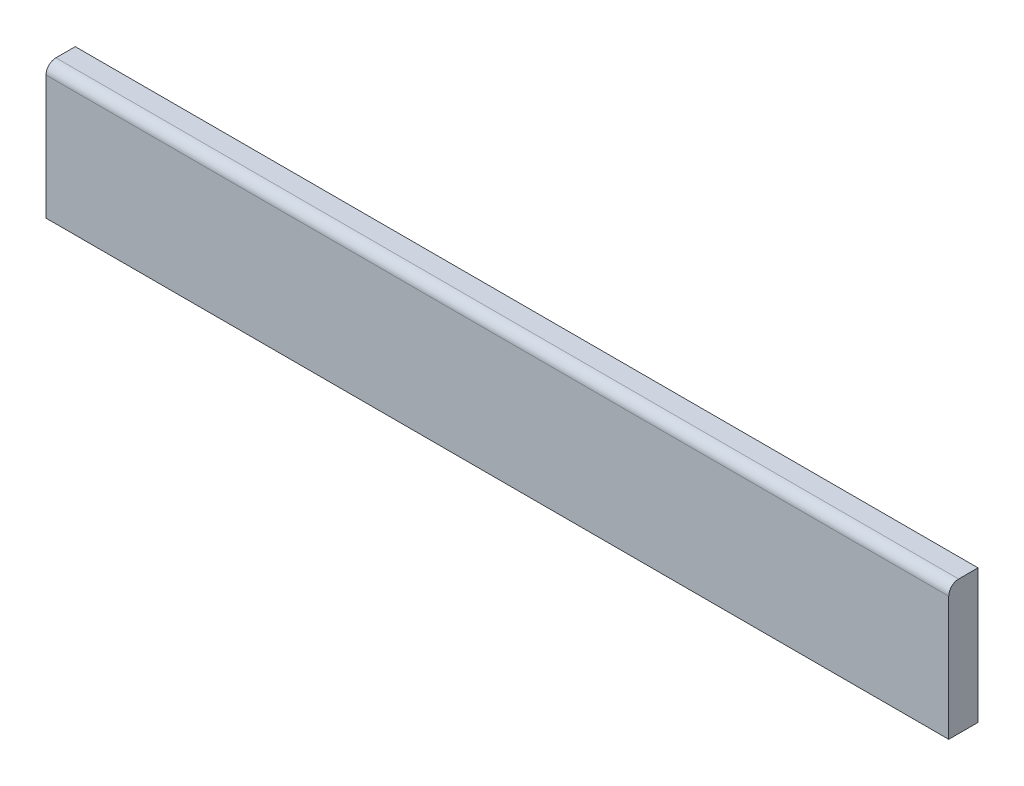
ISO-10303-21;
HEADER;
FILE_DESCRIPTION(('STEP AP214'),'2;1');
FILE_NAME('part.step','',(''),(''),'','','');
FILE_SCHEMA(('AUTOMOTIVE_DESIGN { 1 0 10303 214 1 1 1 1 }'));
ENDSEC;
DATA;
#1=APPLICATION_CONTEXT('core data for automotive mechanical design processes');
#2=APPLICATION_PROTOCOL_DEFINITION('international standard','automotive_design',2000,#1);
#3=PRODUCT_CONTEXT('',#1,'mechanical');
#4=PRODUCT('Part','Part','',(#3));
#5=PRODUCT_RELATED_PRODUCT_CATEGORY('part','',(#4));
#6=PRODUCT_DEFINITION_FORMATION('','',#4);
#7=PRODUCT_DEFINITION_CONTEXT('part definition',#1,'design');
#8=PRODUCT_DEFINITION('design','',#6,#7);
#9=PRODUCT_DEFINITION_SHAPE('','',#8);
#10=(LENGTH_UNIT() NAMED_UNIT(*) SI_UNIT(.MILLI.,.METRE.));
#11=(NAMED_UNIT(*) PLANE_ANGLE_UNIT() SI_UNIT($,.RADIAN.));
#12=(NAMED_UNIT(*) SI_UNIT($,.STERADIAN.) SOLID_ANGLE_UNIT());
#13=UNCERTAINTY_MEASURE_WITH_UNIT(LENGTH_MEASURE(1.E-05),#10,'distance_accuracy_value','');
#14=(GEOMETRIC_REPRESENTATION_CONTEXT(3) GLOBAL_UNCERTAINTY_ASSIGNED_CONTEXT((#13)) GLOBAL_UNIT_ASSIGNED_CONTEXT((#10,
#11,#12)) REPRESENTATION_CONTEXT('',''));
#15=CARTESIAN_POINT('',(0.,0.,0.));
#16=DIRECTION('',(0.,0.,1.));
#17=DIRECTION('',(1.,0.,0.));
#18=AXIS2_PLACEMENT_3D('',#15,#16,#17);
#19=CARTESIAN_POINT('',(0.,0.,0.));
#20=DIRECTION('',(0.,0.,1.));
#21=DIRECTION('',(1.,0.,0.));
#22=AXIS2_PLACEMENT_3D('',#19,#20,#21);
#23=PLANE('',#22);
#24=CARTESIAN_POINT('',(27.,-76.9999999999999,0.));
#25=DIRECTION('',(0.,0.,1.));
#26=DIRECTION('',(1.,0.,0.));
#27=AXIS2_PLACEMENT_3D('',#24,#25,#26);
#28=CIRCLE('',#27,5.);
#29=CARTESIAN_POINT('',(32.,-76.9999999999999,0.));
#30=VERTEX_POINT('',#29);
#31=EDGE_CURVE('E158',#30,#30,#28,.T.);
#32=ORIENTED_EDGE('',*,*,#31,.T.);
#33=EDGE_LOOP('',(#32));
#34=FACE_BOUND('',#33,.T.);
#35=CARTESIAN_POINT('',(27.,-40.9999999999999,0.));
#36=DIRECTION('',(0.,0.,1.));
#37=DIRECTION('',(1.,0.,0.));
#38=AXIS2_PLACEMENT_3D('',#35,#36,#37);
#39=CIRCLE('',#38,5.);
#40=CARTESIAN_POINT('',(32.,-40.9999999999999,0.));
#41=VERTEX_POINT('',#40);
#42=EDGE_CURVE('E149',#41,#41,#39,.T.);
#43=ORIENTED_EDGE('',*,*,#42,.T.);
#44=EDGE_LOOP('',(#43));
#45=FACE_BOUND('',#44,.T.);
#46=CARTESIAN_POINT('',(-27.,-40.9999999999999,0.));
#47=DIRECTION('',(0.,0.,1.));
#48=DIRECTION('',(1.,0.,0.));
#49=AXIS2_PLACEMENT_3D('',#46,#47,#48);
#50=CIRCLE('',#49,5.);
#51=CARTESIAN_POINT('',(-22.,-40.9999999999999,0.));
#52=VERTEX_POINT('',#51);
#53=EDGE_CURVE('E144',#52,#52,#50,.T.);
#54=ORIENTED_EDGE('',*,*,#53,.T.);
#55=EDGE_LOOP('',(#54));
#56=FACE_BOUND('',#55,.T.);
#57=CARTESIAN_POINT('',(-27.,-76.9999999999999,0.));
#58=DIRECTION('',(0.,0.,1.));
#59=DIRECTION('',(1.,0.,0.));
#60=AXIS2_PLACEMENT_3D('',#57,#58,#59);
#61=CIRCLE('',#60,5.);
#62=CARTESIAN_POINT('',(-22.,-76.9999999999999,0.));
#63=VERTEX_POINT('',#62);
#64=EDGE_CURVE('E148',#63,#63,#61,.T.);
#65=ORIENTED_EDGE('',*,*,#64,.T.);
#66=EDGE_LOOP('',(#65));
#67=FACE_BOUND('',#66,.T.);
#68=DIRECTION('',(-1.,0.,0.));
#69=VECTOR('',#68,1.);
#70=CARTESIAN_POINT('',(-949.,113.,0.));
#71=LINE('',#70,#69);
#72=CARTESIAN_POINT('',(910.,113.,6.88846842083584E-13));
#73=VERTEX_POINT('',#72);
#74=CARTESIAN_POINT('',(-910.,113.,-1.10138778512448E-12));
#75=VERTEX_POINT('',#74);
#76=EDGE_CURVE('E102',#73,#75,#71,.T.);
#77=ORIENTED_EDGE('',*,*,#76,.F.);
#78=DIRECTION('',(0.,1.,0.));
#79=VECTOR('',#78,1.);
#80=CARTESIAN_POINT('',(910.,-157.,7.33810874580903E-13));
#81=LINE('',#80,#79);
#82=CARTESIAN_POINT('',(910.,-157.,7.33810874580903E-13));
#83=VERTEX_POINT('',#82);
#84=EDGE_CURVE('E87',#83,#73,#81,.T.);
#85=ORIENTED_EDGE('',*,*,#84,.F.);
#86=DIRECTION('',(1.,0.,0.));
#87=VECTOR('',#86,1.);
#88=CARTESIAN_POINT('',(-949.,-157.,0.));
#89=LINE('',#88,#87);
#90=CARTESIAN_POINT('',(-910.,-157.,-1.05642375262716E-12));
#91=VERTEX_POINT('',#90);
#92=EDGE_CURVE('E100',#91,#83,#89,.T.);
#93=ORIENTED_EDGE('',*,*,#92,.F.);
#94=DIRECTION('',(0.,1.,0.));
#95=VECTOR('',#94,1.);
#96=CARTESIAN_POINT('',(-910.,-157.,-1.05642375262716E-12));
#97=LINE('',#96,#95);
#98=EDGE_CURVE('E141',#91,#75,#97,.T.);
#99=ORIENTED_EDGE('',*,*,#98,.T.);
#100=EDGE_LOOP('',(#77,#85,#93,#99));
#101=FACE_BOUND('',#100,.T.);
#102=CARTESIAN_POINT('',(-490.,0.,0.));
#103=DIRECTION('',(0.,0.,1.));
#104=DIRECTION('',(1.,0.,0.));
#105=AXIS2_PLACEMENT_3D('',#102,#103,#104);
#106=CIRCLE('',#105,5.00000000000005);
#107=CARTESIAN_POINT('',(-485.,0.,0.));
#108=VERTEX_POINT('',#107);
#109=EDGE_CURVE('E108',#108,#108,#106,.T.);
#110=ORIENTED_EDGE('',*,*,#109,.T.);
#111=EDGE_LOOP('',(#110));
#112=FACE_BOUND('',#111,.T.);
#113=CARTESIAN_POINT('',(-855.,0.,0.));
#114=DIRECTION('',(0.,0.,1.));
#115=DIRECTION('',(1.,0.,0.));
#116=AXIS2_PLACEMENT_3D('',#113,#114,#115);
#117=CIRCLE('',#116,5.00000000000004);
#118=CARTESIAN_POINT('',(-850.,0.,0.));
#119=VERTEX_POINT('',#118);
#120=EDGE_CURVE('E115',#119,#119,#117,.T.);
#121=ORIENTED_EDGE('',*,*,#120,.T.);
#122=EDGE_LOOP('',(#121));
#123=FACE_BOUND('',#122,.T.);
#124=CARTESIAN_POINT('',(-125.,0.,0.));
#125=DIRECTION('',(0.,0.,1.));
#126=DIRECTION('',(1.,0.,0.));
#127=AXIS2_PLACEMENT_3D('',#124,#125,#126);
#128=CIRCLE('',#127,4.99999999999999);
#129=CARTESIAN_POINT('',(-120.,0.,0.));
#130=VERTEX_POINT('',#129);
#131=EDGE_CURVE('E258',#130,#130,#128,.T.);
#132=ORIENTED_EDGE('',*,*,#131,.T.);
#133=EDGE_LOOP('',(#132));
#134=FACE_BOUND('',#133,.T.);
#135=CARTESIAN_POINT('',(-872.6,-136.999999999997,0.));
#136=DIRECTION('',(0.,0.,1.));
#137=DIRECTION('',(1.,0.,0.));
#138=AXIS2_PLACEMENT_3D('',#135,#136,#137);
#139=CIRCLE('',#138,5.00000000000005);
#140=CARTESIAN_POINT('',(-867.6,-136.999999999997,0.));
#141=VERTEX_POINT('',#140);
#142=EDGE_CURVE('E251',#141,#141,#139,.T.);
#143=ORIENTED_EDGE('',*,*,#142,.T.);
#144=EDGE_LOOP('',(#143));
#145=FACE_BOUND('',#144,.T.);
#146=CARTESIAN_POINT('',(-872.6,-56.9999999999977,0.));
#147=DIRECTION('',(0.,0.,1.));
#148=DIRECTION('',(1.,0.,0.));
#149=AXIS2_PLACEMENT_3D('',#146,#147,#148);
#150=CIRCLE('',#149,5.00000000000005);
#151=CARTESIAN_POINT('',(-867.6,-56.9999999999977,0.));
#152=VERTEX_POINT('',#151);
#153=EDGE_CURVE('E244',#152,#152,#150,.T.);
#154=ORIENTED_EDGE('',*,*,#153,.T.);
#155=EDGE_LOOP('',(#154));
#156=FACE_BOUND('',#155,.T.);
#157=CARTESIAN_POINT('',(-793.,-142.000000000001,0.));
#158=DIRECTION('',(0.,0.,1.));
#159=DIRECTION('',(1.,0.,0.));
#160=AXIS2_PLACEMENT_3D('',#157,#158,#159);
#161=CIRCLE('',#160,5.00000000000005);
#162=CARTESIAN_POINT('',(-788.,-142.000000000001,0.));
#163=VERTEX_POINT('',#162);
#164=EDGE_CURVE('E237',#163,#163,#161,.T.);
#165=ORIENTED_EDGE('',*,*,#164,.T.);
#166=EDGE_LOOP('',(#165));
#167=FACE_BOUND('',#166,.T.);
#168=CARTESIAN_POINT('',(872.6,-136.999999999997,0.));
#169=DIRECTION('',(0.,0.,1.));
#170=DIRECTION('',(1.,0.,0.));
#171=AXIS2_PLACEMENT_3D('',#168,#169,#170);
#172=CIRCLE('',#171,4.99999999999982);
#173=CARTESIAN_POINT('',(877.6,-136.999999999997,0.));
#174=VERTEX_POINT('',#173);
#175=EDGE_CURVE('E230',#174,#174,#172,.T.);
#176=ORIENTED_EDGE('',*,*,#175,.T.);
#177=EDGE_LOOP('',(#176));
#178=FACE_BOUND('',#177,.T.);
#179=CARTESIAN_POINT('',(-428.,-142.000000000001,0.));
#180=DIRECTION('',(0.,0.,1.));
#181=DIRECTION('',(1.,0.,0.));
#182=AXIS2_PLACEMENT_3D('',#179,#180,#181);
#183=CIRCLE('',#182,5.00000000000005);
#184=CARTESIAN_POINT('',(-423.,-142.000000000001,0.));
#185=VERTEX_POINT('',#184);
#186=EDGE_CURVE('E223',#185,#185,#183,.T.);
#187=ORIENTED_EDGE('',*,*,#186,.T.);
#188=EDGE_LOOP('',(#187));
#189=FACE_BOUND('',#188,.T.);
#190=CARTESIAN_POINT('',(872.6,-56.9999999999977,0.));
#191=DIRECTION('',(0.,0.,1.));
#192=DIRECTION('',(1.,0.,0.));
#193=AXIS2_PLACEMENT_3D('',#190,#191,#192);
#194=CIRCLE('',#193,4.99999999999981);
#195=CARTESIAN_POINT('',(877.6,-56.9999999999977,0.));
#196=VERTEX_POINT('',#195);
#197=EDGE_CURVE('E216',#196,#196,#194,.T.);
#198=ORIENTED_EDGE('',*,*,#197,.T.);
#199=EDGE_LOOP('',(#198));
#200=FACE_BOUND('',#199,.T.);
#201=CARTESIAN_POINT('',(-63.0000000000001,-142.000000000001,0.));
#202=DIRECTION('',(0.,0.,1.));
#203=DIRECTION('',(1.,0.,0.));
#204=AXIS2_PLACEMENT_3D('',#201,#202,#203);
#205=CIRCLE('',#204,4.99999999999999);
#206=CARTESIAN_POINT('',(-58.0000000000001,-142.000000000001,0.));
#207=VERTEX_POINT('',#206);
#208=EDGE_CURVE('E209',#207,#207,#205,.T.);
#209=ORIENTED_EDGE('',*,*,#208,.T.);
#210=EDGE_LOOP('',(#209));
#211=FACE_BOUND('',#210,.T.);
#212=CARTESIAN_POINT('',(125.,0.,0.));
#213=DIRECTION('',(0.,0.,1.));
#214=DIRECTION('',(-1.,0.,0.));
#215=AXIS2_PLACEMENT_3D('',#212,#213,#214);
#216=CIRCLE('',#215,4.99999999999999);
#217=CARTESIAN_POINT('',(120.,0.,0.));
#218=VERTEX_POINT('',#217);
#219=EDGE_CURVE('E203',#218,#218,#216,.T.);
#220=ORIENTED_EDGE('',*,*,#219,.T.);
#221=EDGE_LOOP('',(#220));
#222=FACE_BOUND('',#221,.T.);
#223=CARTESIAN_POINT('',(63.0000000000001,-142.000000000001,0.));
#224=DIRECTION('',(0.,0.,1.));
#225=DIRECTION('',(-1.,0.,0.));
#226=AXIS2_PLACEMENT_3D('',#223,#224,#225);
#227=CIRCLE('',#226,4.99999999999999);
#228=CARTESIAN_POINT('',(58.0000000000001,-142.000000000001,0.));
#229=VERTEX_POINT('',#228);
#230=EDGE_CURVE('E197',#229,#229,#227,.T.);
#231=ORIENTED_EDGE('',*,*,#230,.T.);
#232=EDGE_LOOP('',(#231));
#233=FACE_BOUND('',#232,.T.);
#234=CARTESIAN_POINT('',(490.,0.,0.));
#235=DIRECTION('',(0.,0.,1.));
#236=DIRECTION('',(-1.,0.,0.));
#237=AXIS2_PLACEMENT_3D('',#234,#235,#236);
#238=CIRCLE('',#237,5.00000000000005);
#239=CARTESIAN_POINT('',(485.,0.,0.));
#240=VERTEX_POINT('',#239);
#241=EDGE_CURVE('E191',#240,#240,#238,.T.);
#242=ORIENTED_EDGE('',*,*,#241,.T.);
#243=EDGE_LOOP('',(#242));
#244=FACE_BOUND('',#243,.T.);
#245=CARTESIAN_POINT('',(855.,0.,0.));
#246=DIRECTION('',(0.,0.,1.));
#247=DIRECTION('',(-1.,0.,0.));
#248=AXIS2_PLACEMENT_3D('',#245,#246,#247);
#249=CIRCLE('',#248,5.00000000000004);
#250=CARTESIAN_POINT('',(850.,0.,0.));
#251=VERTEX_POINT('',#250);
#252=EDGE_CURVE('E185',#251,#251,#249,.T.);
#253=ORIENTED_EDGE('',*,*,#252,.T.);
#254=EDGE_LOOP('',(#253));
#255=FACE_BOUND('',#254,.T.);
#256=CARTESIAN_POINT('',(428.,-142.000000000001,0.));
#257=DIRECTION('',(0.,0.,1.));
#258=DIRECTION('',(-1.,0.,0.));
#259=AXIS2_PLACEMENT_3D('',#256,#257,#258);
#260=CIRCLE('',#259,5.00000000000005);
#261=CARTESIAN_POINT('',(423.,-142.000000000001,0.));
#262=VERTEX_POINT('',#261);
#263=EDGE_CURVE('E179',#262,#262,#260,.T.);
#264=ORIENTED_EDGE('',*,*,#263,.T.);
#265=EDGE_LOOP('',(#264));
#266=FACE_BOUND('',#265,.T.);
#267=CARTESIAN_POINT('',(793.,-142.000000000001,0.));
#268=DIRECTION('',(0.,0.,1.));
#269=DIRECTION('',(-1.,0.,0.));
#270=AXIS2_PLACEMENT_3D('',#267,#268,#269);
#271=CIRCLE('',#270,5.00000000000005);
#272=CARTESIAN_POINT('',(788.,-142.000000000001,0.));
#273=VERTEX_POINT('',#272);
#274=EDGE_CURVE('E170',#273,#273,#271,.T.);
#275=ORIENTED_EDGE('',*,*,#274,.T.);
#276=EDGE_LOOP('',(#275));
#277=FACE_BOUND('',#276,.T.);
#278=ADVANCED_FACE('F40',(#34,#45,#56,#67,#101,#112,#123,#134,#145,#156,#167,#178,#189,#200,
#211,#222,#233,#244,#255,#266,#277),#23,.F.);
#279=CARTESIAN_POINT('',(-949.,-157.,16.));
#280=DIRECTION('',(0.,1.,0.));
#281=DIRECTION('',(0.,0.,1.));
#282=AXIS2_PLACEMENT_3D('',#279,#280,#281);
#283=PLANE('',#282);
#284=ORIENTED_EDGE('',*,*,#92,.T.);
#285=DIRECTION('',(0.,0.,1.));
#286=VECTOR('',#285,1.);
#287=CARTESIAN_POINT('',(910.,-157.,7.33810874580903E-13));
#288=LINE('',#287,#286);
#289=CARTESIAN_POINT('',(910.,-157.,59.0000000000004));
#290=VERTEX_POINT('',#289);
#291=EDGE_CURVE('E84',#83,#290,#288,.T.);
#292=ORIENTED_EDGE('',*,*,#291,.T.);
#293=DIRECTION('',(1.,0.,0.));
#294=VECTOR('',#293,1.);
#295=CARTESIAN_POINT('',(-969.,-157.,59.));
#296=LINE('',#295,#294);
#297=CARTESIAN_POINT('',(-910.,-157.,58.9999999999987));
#298=VERTEX_POINT('',#297);
#299=EDGE_CURVE('E134',#298,#290,#296,.T.);
#300=ORIENTED_EDGE('',*,*,#299,.F.);
#301=DIRECTION('',(0.,0.,-1.));
#302=VECTOR('',#301,1.);
#303=CARTESIAN_POINT('',(-910.,-157.,-1.05642375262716E-12));
#304=LINE('',#303,#302);
#305=EDGE_CURVE('E106',#298,#91,#304,.T.);
#306=ORIENTED_EDGE('',*,*,#305,.T.);
#307=EDGE_LOOP('',(#284,#292,#300,#306));
#308=FACE_BOUND('',#307,.T.);
#309=ADVANCED_FACE('F105',(#308),#283,.F.);
#310=CARTESIAN_POINT('',(-949.,113.,16.));
#311=DIRECTION('',(0.,-1.,0.));
#312=DIRECTION('',(0.,0.,-1.));
#313=AXIS2_PLACEMENT_3D('',#310,#311,#312);
#314=PLANE('',#313);
#315=DIRECTION('',(-1.,0.,0.));
#316=VECTOR('',#315,1.);
#317=CARTESIAN_POINT('',(969.,113.,39.));
#318=LINE('',#317,#316);
#319=CARTESIAN_POINT('',(-910.,113.,39.));
#320=VERTEX_POINT('',#319);
#321=CARTESIAN_POINT('',(910.,113.,39.));
#322=VERTEX_POINT('',#321);
#323=EDGE_CURVE('E121',#320,#322,#318,.F.);
#324=ORIENTED_EDGE('',*,*,#323,.T.);
#325=DIRECTION('',(0.,0.,1.));
#326=VECTOR('',#325,1.);
#327=CARTESIAN_POINT('',(910.,113.,6.88846842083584E-13));
#328=LINE('',#327,#326);
#329=EDGE_CURVE('E54',#73,#322,#328,.T.);
#330=ORIENTED_EDGE('',*,*,#329,.F.);
#331=ORIENTED_EDGE('',*,*,#76,.T.);
#332=DIRECTION('',(0.,0.,-1.));
#333=VECTOR('',#332,1.);
#334=CARTESIAN_POINT('',(-910.,113.,-1.10138778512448E-12));
#335=LINE('',#334,#333);
#336=EDGE_CURVE('E125',#320,#75,#335,.T.);
#337=ORIENTED_EDGE('',*,*,#336,.F.);
#338=EDGE_LOOP('',(#324,#330,#331,#337));
#339=FACE_BOUND('',#338,.T.);
#340=ADVANCED_FACE('F130',(#339),#314,.F.);
#341=CARTESIAN_POINT('',(-490.,0.,16.));
#342=DIRECTION('',(0.,0.,-1.));
#343=DIRECTION('',(-1.,0.,0.));
#344=AXIS2_PLACEMENT_3D('',#341,#342,#343);
#345=CYLINDRICAL_SURFACE('',#344,5.00000000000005);
#346=CARTESIAN_POINT('',(-490.,0.,16.));
#347=DIRECTION('',(0.,0.,1.));
#348=DIRECTION('',(1.,0.,0.));
#349=AXIS2_PLACEMENT_3D('',#346,#347,#348);
#350=CIRCLE('',#349,5.00000000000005);
#351=CARTESIAN_POINT('',(-485.,0.,16.));
#352=VERTEX_POINT('',#351);
#353=EDGE_CURVE('E261',#352,#352,#350,.T.);
#354=ORIENTED_EDGE('',*,*,#353,.T.);
#355=EDGE_LOOP('',(#354));
#356=FACE_BOUND('',#355,.T.);
#357=ORIENTED_EDGE('',*,*,#109,.F.);
#358=EDGE_LOOP('',(#357));
#359=FACE_BOUND('',#358,.T.);
#360=ADVANCED_FACE('F270',(#356,#359),#345,.F.);
#361=CARTESIAN_POINT('',(-855.,0.,16.));
#362=DIRECTION('',(0.,0.,-1.));
#363=DIRECTION('',(-1.,0.,0.));
#364=AXIS2_PLACEMENT_3D('',#361,#362,#363);
#365=CYLINDRICAL_SURFACE('',#364,5.00000000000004);
#366=CARTESIAN_POINT('',(-855.,0.,16.));
#367=DIRECTION('',(0.,0.,1.));
#368=DIRECTION('',(1.,0.,0.));
#369=AXIS2_PLACEMENT_3D('',#366,#367,#368);
#370=CIRCLE('',#369,5.00000000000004);
#371=CARTESIAN_POINT('',(-850.,0.,16.));
#372=VERTEX_POINT('',#371);
#373=EDGE_CURVE('E254',#372,#372,#370,.T.);
#374=ORIENTED_EDGE('',*,*,#373,.T.);
#375=EDGE_LOOP('',(#374));
#376=FACE_BOUND('',#375,.T.);
#377=ORIENTED_EDGE('',*,*,#120,.F.);
#378=EDGE_LOOP('',(#377));
#379=FACE_BOUND('',#378,.T.);
#380=ADVANCED_FACE('F305',(#376,#379),#365,.F.);
#381=CARTESIAN_POINT('',(-125.,0.,16.));
#382=DIRECTION('',(0.,0.,-1.));
#383=DIRECTION('',(-1.,0.,0.));
#384=AXIS2_PLACEMENT_3D('',#381,#382,#383);
#385=CYLINDRICAL_SURFACE('',#384,4.99999999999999);
#386=CARTESIAN_POINT('',(-125.,0.,16.));
#387=DIRECTION('',(0.,0.,1.));
#388=DIRECTION('',(1.,0.,0.));
#389=AXIS2_PLACEMENT_3D('',#386,#387,#388);
#390=CIRCLE('',#389,4.99999999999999);
#391=CARTESIAN_POINT('',(-120.,0.,16.));
#392=VERTEX_POINT('',#391);
#393=EDGE_CURVE('E247',#392,#392,#390,.T.);
#394=ORIENTED_EDGE('',*,*,#393,.T.);
#395=EDGE_LOOP('',(#394));
#396=FACE_BOUND('',#395,.T.);
#397=ORIENTED_EDGE('',*,*,#131,.F.);
#398=EDGE_LOOP('',(#397));
#399=FACE_BOUND('',#398,.T.);
#400=ADVANCED_FACE('F309',(#396,#399),#385,.F.);
#401=CARTESIAN_POINT('',(-872.6,-136.999999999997,16.));
#402=DIRECTION('',(0.,0.,-1.));
#403=DIRECTION('',(-1.,0.,0.));
#404=AXIS2_PLACEMENT_3D('',#401,#402,#403);
#405=CYLINDRICAL_SURFACE('',#404,5.00000000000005);
#406=CARTESIAN_POINT('',(-872.6,-136.999999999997,16.));
#407=DIRECTION('',(0.,0.,1.));
#408=DIRECTION('',(1.,0.,0.));
#409=AXIS2_PLACEMENT_3D('',#406,#407,#408);
#410=CIRCLE('',#409,5.00000000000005);
#411=CARTESIAN_POINT('',(-867.6,-136.999999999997,16.));
#412=VERTEX_POINT('',#411);
#413=EDGE_CURVE('E240',#412,#412,#410,.T.);
#414=ORIENTED_EDGE('',*,*,#413,.T.);
#415=EDGE_LOOP('',(#414));
#416=FACE_BOUND('',#415,.T.);
#417=ORIENTED_EDGE('',*,*,#142,.F.);
#418=EDGE_LOOP('',(#417));
#419=FACE_BOUND('',#418,.T.);
#420=ADVANCED_FACE('F314',(#416,#419),#405,.F.);
#421=CARTESIAN_POINT('',(-872.6,-56.9999999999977,16.));
#422=DIRECTION('',(0.,0.,-1.));
#423=DIRECTION('',(-1.,0.,0.));
#424=AXIS2_PLACEMENT_3D('',#421,#422,#423);
#425=CYLINDRICAL_SURFACE('',#424,5.00000000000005);
#426=CARTESIAN_POINT('',(-872.6,-56.9999999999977,16.));
#427=DIRECTION('',(0.,0.,1.));
#428=DIRECTION('',(1.,0.,0.));
#429=AXIS2_PLACEMENT_3D('',#426,#427,#428);
#430=CIRCLE('',#429,5.00000000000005);
#431=CARTESIAN_POINT('',(-867.6,-56.9999999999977,16.));
#432=VERTEX_POINT('',#431);
#433=EDGE_CURVE('E233',#432,#432,#430,.T.);
#434=ORIENTED_EDGE('',*,*,#433,.T.);
#435=EDGE_LOOP('',(#434));
#436=FACE_BOUND('',#435,.T.);
#437=ORIENTED_EDGE('',*,*,#153,.F.);
#438=EDGE_LOOP('',(#437));
#439=FACE_BOUND('',#438,.T.);
#440=ADVANCED_FACE('F321',(#436,#439),#425,.F.);
#441=CARTESIAN_POINT('',(-793.,-142.000000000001,16.));
#442=DIRECTION('',(0.,0.,-1.));
#443=DIRECTION('',(-1.,0.,0.));
#444=AXIS2_PLACEMENT_3D('',#441,#442,#443);
#445=CYLINDRICAL_SURFACE('',#444,5.00000000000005);
#446=CARTESIAN_POINT('',(-793.,-142.000000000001,16.));
#447=DIRECTION('',(0.,0.,1.));
#448=DIRECTION('',(1.,0.,0.));
#449=AXIS2_PLACEMENT_3D('',#446,#447,#448);
#450=CIRCLE('',#449,5.00000000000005);
#451=CARTESIAN_POINT('',(-788.,-142.000000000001,16.));
#452=VERTEX_POINT('',#451);
#453=EDGE_CURVE('E226',#452,#452,#450,.T.);
#454=ORIENTED_EDGE('',*,*,#453,.T.);
#455=EDGE_LOOP('',(#454));
#456=FACE_BOUND('',#455,.T.);
#457=ORIENTED_EDGE('',*,*,#164,.F.);
#458=EDGE_LOOP('',(#457));
#459=FACE_BOUND('',#458,.T.);
#460=ADVANCED_FACE('F325',(#456,#459),#445,.F.);
#461=CARTESIAN_POINT('',(872.6,-136.999999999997,16.));
#462=DIRECTION('',(0.,0.,-1.));
#463=DIRECTION('',(-1.,0.,0.));
#464=AXIS2_PLACEMENT_3D('',#461,#462,#463);
#465=CYLINDRICAL_SURFACE('',#464,4.99999999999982);
#466=CARTESIAN_POINT('',(872.6,-136.999999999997,16.));
#467=DIRECTION('',(0.,0.,1.));
#468=DIRECTION('',(1.,0.,0.));
#469=AXIS2_PLACEMENT_3D('',#466,#467,#468);
#470=CIRCLE('',#469,4.99999999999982);
#471=CARTESIAN_POINT('',(877.6,-136.999999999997,16.));
#472=VERTEX_POINT('',#471);
#473=EDGE_CURVE('E219',#472,#472,#470,.T.);
#474=ORIENTED_EDGE('',*,*,#473,.T.);
#475=EDGE_LOOP('',(#474));
#476=FACE_BOUND('',#475,.T.);
#477=ORIENTED_EDGE('',*,*,#175,.F.);
#478=EDGE_LOOP('',(#477));
#479=FACE_BOUND('',#478,.T.);
#480=ADVANCED_FACE('F329',(#476,#479),#465,.F.);
#481=CARTESIAN_POINT('',(-428.,-142.000000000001,16.));
#482=DIRECTION('',(0.,0.,-1.));
#483=DIRECTION('',(-1.,0.,0.));
#484=AXIS2_PLACEMENT_3D('',#481,#482,#483);
#485=CYLINDRICAL_SURFACE('',#484,5.00000000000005);
#486=CARTESIAN_POINT('',(-428.,-142.000000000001,16.));
#487=DIRECTION('',(0.,0.,1.));
#488=DIRECTION('',(1.,0.,0.));
#489=AXIS2_PLACEMENT_3D('',#486,#487,#488);
#490=CIRCLE('',#489,5.00000000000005);
#491=CARTESIAN_POINT('',(-423.,-142.000000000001,16.));
#492=VERTEX_POINT('',#491);
#493=EDGE_CURVE('E212',#492,#492,#490,.T.);
#494=ORIENTED_EDGE('',*,*,#493,.T.);
#495=EDGE_LOOP('',(#494));
#496=FACE_BOUND('',#495,.T.);
#497=ORIENTED_EDGE('',*,*,#186,.F.);
#498=EDGE_LOOP('',(#497));
#499=FACE_BOUND('',#498,.T.);
#500=ADVANCED_FACE('F333',(#496,#499),#485,.F.);
#501=CARTESIAN_POINT('',(872.6,-56.9999999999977,16.));
#502=DIRECTION('',(0.,0.,-1.));
#503=DIRECTION('',(-1.,0.,0.));
#504=AXIS2_PLACEMENT_3D('',#501,#502,#503);
#505=CYLINDRICAL_SURFACE('',#504,4.99999999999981);
#506=CARTESIAN_POINT('',(872.6,-56.9999999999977,16.));
#507=DIRECTION('',(0.,0.,1.));
#508=DIRECTION('',(1.,0.,0.));
#509=AXIS2_PLACEMENT_3D('',#506,#507,#508);
#510=CIRCLE('',#509,4.99999999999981);
#511=CARTESIAN_POINT('',(877.6,-56.9999999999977,16.));
#512=VERTEX_POINT('',#511);
#513=EDGE_CURVE('E206',#512,#512,#510,.T.);
#514=ORIENTED_EDGE('',*,*,#513,.T.);
#515=EDGE_LOOP('',(#514));
#516=FACE_BOUND('',#515,.T.);
#517=ORIENTED_EDGE('',*,*,#197,.F.);
#518=EDGE_LOOP('',(#517));
#519=FACE_BOUND('',#518,.T.);
#520=ADVANCED_FACE('F337',(#516,#519),#505,.F.);
#521=CARTESIAN_POINT('',(-63.0000000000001,-142.000000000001,16.));
#522=DIRECTION('',(0.,0.,-1.));
#523=DIRECTION('',(-1.,0.,0.));
#524=AXIS2_PLACEMENT_3D('',#521,#522,#523);
#525=CYLINDRICAL_SURFACE('',#524,4.99999999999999);
#526=CARTESIAN_POINT('',(-63.0000000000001,-142.000000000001,16.));
#527=DIRECTION('',(0.,0.,1.));
#528=DIRECTION('',(1.,0.,0.));
#529=AXIS2_PLACEMENT_3D('',#526,#527,#528);
#530=CIRCLE('',#529,4.99999999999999);
#531=CARTESIAN_POINT('',(-58.0000000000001,-142.000000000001,16.));
#532=VERTEX_POINT('',#531);
#533=EDGE_CURVE('E200',#532,#532,#530,.T.);
#534=ORIENTED_EDGE('',*,*,#533,.T.);
#535=EDGE_LOOP('',(#534));
#536=FACE_BOUND('',#535,.T.);
#537=ORIENTED_EDGE('',*,*,#208,.F.);
#538=EDGE_LOOP('',(#537));
#539=FACE_BOUND('',#538,.T.);
#540=ADVANCED_FACE('F341',(#536,#539),#525,.F.);
#541=CARTESIAN_POINT('',(125.,0.,16.));
#542=DIRECTION('',(0.,0.,-1.));
#543=DIRECTION('',(-1.,0.,0.));
#544=AXIS2_PLACEMENT_3D('',#541,#542,#543);
#545=CYLINDRICAL_SURFACE('',#544,4.99999999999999);
#546=CARTESIAN_POINT('',(125.,0.,16.));
#547=DIRECTION('',(0.,0.,1.));
#548=DIRECTION('',(-1.,0.,0.));
#549=AXIS2_PLACEMENT_3D('',#546,#547,#548);
#550=CIRCLE('',#549,4.99999999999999);
#551=CARTESIAN_POINT('',(120.,0.,16.));
#552=VERTEX_POINT('',#551);
#553=EDGE_CURVE('E194',#552,#552,#550,.T.);
#554=ORIENTED_EDGE('',*,*,#553,.T.);
#555=EDGE_LOOP('',(#554));
#556=FACE_BOUND('',#555,.T.);
#557=ORIENTED_EDGE('',*,*,#219,.F.);
#558=EDGE_LOOP('',(#557));
#559=FACE_BOUND('',#558,.T.);
#560=ADVANCED_FACE('F345',(#556,#559),#545,.F.);
#561=CARTESIAN_POINT('',(63.0000000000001,-142.000000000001,16.));
#562=DIRECTION('',(0.,0.,-1.));
#563=DIRECTION('',(-1.,0.,0.));
#564=AXIS2_PLACEMENT_3D('',#561,#562,#563);
#565=CYLINDRICAL_SURFACE('',#564,4.99999999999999);
#566=CARTESIAN_POINT('',(63.0000000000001,-142.000000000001,16.));
#567=DIRECTION('',(0.,0.,1.));
#568=DIRECTION('',(-1.,0.,0.));
#569=AXIS2_PLACEMENT_3D('',#566,#567,#568);
#570=CIRCLE('',#569,4.99999999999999);
#571=CARTESIAN_POINT('',(58.0000000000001,-142.000000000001,16.));
#572=VERTEX_POINT('',#571);
#573=EDGE_CURVE('E188',#572,#572,#570,.T.);
#574=ORIENTED_EDGE('',*,*,#573,.T.);
#575=EDGE_LOOP('',(#574));
#576=FACE_BOUND('',#575,.T.);
#577=ORIENTED_EDGE('',*,*,#230,.F.);
#578=EDGE_LOOP('',(#577));
#579=FACE_BOUND('',#578,.T.);
#580=ADVANCED_FACE('F349',(#576,#579),#565,.F.);
#581=CARTESIAN_POINT('',(490.,0.,16.));
#582=DIRECTION('',(0.,0.,-1.));
#583=DIRECTION('',(-1.,0.,0.));
#584=AXIS2_PLACEMENT_3D('',#581,#582,#583);
#585=CYLINDRICAL_SURFACE('',#584,5.00000000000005);
#586=CARTESIAN_POINT('',(490.,0.,16.));
#587=DIRECTION('',(0.,0.,1.));
#588=DIRECTION('',(-1.,0.,0.));
#589=AXIS2_PLACEMENT_3D('',#586,#587,#588);
#590=CIRCLE('',#589,5.00000000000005);
#591=CARTESIAN_POINT('',(485.,0.,16.));
#592=VERTEX_POINT('',#591);
#593=EDGE_CURVE('E182',#592,#592,#590,.T.);
#594=ORIENTED_EDGE('',*,*,#593,.T.);
#595=EDGE_LOOP('',(#594));
#596=FACE_BOUND('',#595,.T.);
#597=ORIENTED_EDGE('',*,*,#241,.F.);
#598=EDGE_LOOP('',(#597));
#599=FACE_BOUND('',#598,.T.);
#600=ADVANCED_FACE('F353',(#596,#599),#585,.F.);
#601=CARTESIAN_POINT('',(855.,0.,16.));
#602=DIRECTION('',(0.,0.,-1.));
#603=DIRECTION('',(-1.,0.,0.));
#604=AXIS2_PLACEMENT_3D('',#601,#602,#603);
#605=CYLINDRICAL_SURFACE('',#604,5.00000000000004);
#606=CARTESIAN_POINT('',(855.,0.,16.));
#607=DIRECTION('',(0.,0.,1.));
#608=DIRECTION('',(-1.,0.,0.));
#609=AXIS2_PLACEMENT_3D('',#606,#607,#608);
#610=CIRCLE('',#609,5.00000000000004);
#611=CARTESIAN_POINT('',(850.,0.,16.));
#612=VERTEX_POINT('',#611);
#613=EDGE_CURVE('E176',#612,#612,#610,.T.);
#614=ORIENTED_EDGE('',*,*,#613,.T.);
#615=EDGE_LOOP('',(#614));
#616=FACE_BOUND('',#615,.T.);
#617=ORIENTED_EDGE('',*,*,#252,.F.);
#618=EDGE_LOOP('',(#617));
#619=FACE_BOUND('',#618,.T.);
#620=ADVANCED_FACE('F357',(#616,#619),#605,.F.);
#621=CARTESIAN_POINT('',(428.,-142.000000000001,16.));
#622=DIRECTION('',(0.,0.,-1.));
#623=DIRECTION('',(-1.,0.,0.));
#624=AXIS2_PLACEMENT_3D('',#621,#622,#623);
#625=CYLINDRICAL_SURFACE('',#624,5.00000000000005);
#626=CARTESIAN_POINT('',(428.,-142.000000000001,16.));
#627=DIRECTION('',(0.,0.,1.));
#628=DIRECTION('',(-1.,0.,0.));
#629=AXIS2_PLACEMENT_3D('',#626,#627,#628);
#630=CIRCLE('',#629,5.00000000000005);
#631=CARTESIAN_POINT('',(423.,-142.000000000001,16.));
#632=VERTEX_POINT('',#631);
#633=EDGE_CURVE('E173',#632,#632,#630,.T.);
#634=ORIENTED_EDGE('',*,*,#633,.T.);
#635=EDGE_LOOP('',(#634));
#636=FACE_BOUND('',#635,.T.);
#637=ORIENTED_EDGE('',*,*,#263,.F.);
#638=EDGE_LOOP('',(#637));
#639=FACE_BOUND('',#638,.T.);
#640=ADVANCED_FACE('F361',(#636,#639),#625,.F.);
#641=CARTESIAN_POINT('',(793.,-142.000000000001,16.));
#642=DIRECTION('',(0.,0.,-1.));
#643=DIRECTION('',(-1.,0.,0.));
#644=AXIS2_PLACEMENT_3D('',#641,#642,#643);
#645=CYLINDRICAL_SURFACE('',#644,5.00000000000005);
#646=CARTESIAN_POINT('',(793.,-142.000000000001,16.));
#647=DIRECTION('',(0.,0.,1.));
#648=DIRECTION('',(-1.,0.,0.));
#649=AXIS2_PLACEMENT_3D('',#646,#647,#648);
#650=CIRCLE('',#649,5.00000000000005);
#651=CARTESIAN_POINT('',(788.,-142.000000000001,16.));
#652=VERTEX_POINT('',#651);
#653=EDGE_CURVE('E136',#652,#652,#650,.T.);
#654=ORIENTED_EDGE('',*,*,#653,.T.);
#655=EDGE_LOOP('',(#654));
#656=FACE_BOUND('',#655,.T.);
#657=ORIENTED_EDGE('',*,*,#274,.F.);
#658=EDGE_LOOP('',(#657));
#659=FACE_BOUND('',#658,.T.);
#660=ADVANCED_FACE('F365',(#656,#659),#645,.F.);
#661=CARTESIAN_POINT('',(-27.,-76.9999999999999,0.));
#662=DIRECTION('',(0.,0.,1.));
#663=DIRECTION('',(1.,0.,0.));
#664=AXIS2_PLACEMENT_3D('',#661,#662,#663);
#665=CYLINDRICAL_SURFACE('',#664,5.);
#666=ORIENTED_EDGE('',*,*,#64,.F.);
#667=EDGE_LOOP('',(#666));
#668=FACE_BOUND('',#667,.T.);
#669=CARTESIAN_POINT('',(-27.,-76.9999999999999,16.));
#670=DIRECTION('',(0.,0.,1.));
#671=DIRECTION('',(1.,0.,0.));
#672=AXIS2_PLACEMENT_3D('',#669,#670,#671);
#673=CIRCLE('',#672,5.);
#674=CARTESIAN_POINT('',(-22.,-76.9999999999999,16.));
#675=VERTEX_POINT('',#674);
#676=EDGE_CURVE('E154',#675,#675,#673,.T.);
#677=ORIENTED_EDGE('',*,*,#676,.T.);
#678=EDGE_LOOP('',(#677));
#679=FACE_BOUND('',#678,.T.);
#680=ADVANCED_FACE('F369',(#668,#679),#665,.F.);
#681=CARTESIAN_POINT('',(-27.,-40.9999999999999,0.));
#682=DIRECTION('',(0.,0.,1.));
#683=DIRECTION('',(1.,0.,0.));
#684=AXIS2_PLACEMENT_3D('',#681,#682,#683);
#685=CYLINDRICAL_SURFACE('',#684,5.);
#686=ORIENTED_EDGE('',*,*,#53,.F.);
#687=EDGE_LOOP('',(#686));
#688=FACE_BOUND('',#687,.T.);
#689=CARTESIAN_POINT('',(-27.,-40.9999999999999,16.));
#690=DIRECTION('',(0.,0.,1.));
#691=DIRECTION('',(1.,0.,0.));
#692=AXIS2_PLACEMENT_3D('',#689,#690,#691);
#693=CIRCLE('',#692,5.);
#694=CARTESIAN_POINT('',(-22.,-40.9999999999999,16.));
#695=VERTEX_POINT('',#694);
#696=EDGE_CURVE('E150',#695,#695,#693,.T.);
#697=ORIENTED_EDGE('',*,*,#696,.T.);
#698=EDGE_LOOP('',(#697));
#699=FACE_BOUND('',#698,.T.);
#700=ADVANCED_FACE('F373',(#688,#699),#685,.F.);
#701=CARTESIAN_POINT('',(27.,-40.9999999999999,0.));
#702=DIRECTION('',(0.,0.,1.));
#703=DIRECTION('',(1.,0.,0.));
#704=AXIS2_PLACEMENT_3D('',#701,#702,#703);
#705=CYLINDRICAL_SURFACE('',#704,5.);
#706=ORIENTED_EDGE('',*,*,#42,.F.);
#707=EDGE_LOOP('',(#706));
#708=FACE_BOUND('',#707,.T.);
#709=CARTESIAN_POINT('',(27.,-40.9999999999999,16.));
#710=DIRECTION('',(0.,0.,1.));
#711=DIRECTION('',(1.,0.,0.));
#712=AXIS2_PLACEMENT_3D('',#709,#710,#711);
#713=CIRCLE('',#712,5.);
#714=CARTESIAN_POINT('',(32.,-40.9999999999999,16.));
#715=VERTEX_POINT('',#714);
#716=EDGE_CURVE('E153',#715,#715,#713,.T.);
#717=ORIENTED_EDGE('',*,*,#716,.T.);
#718=EDGE_LOOP('',(#717));
#719=FACE_BOUND('',#718,.T.);
#720=ADVANCED_FACE('F379',(#708,#719),#705,.F.);
#721=CARTESIAN_POINT('',(27.,-76.9999999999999,0.));
#722=DIRECTION('',(0.,0.,1.));
#723=DIRECTION('',(1.,0.,0.));
#724=AXIS2_PLACEMENT_3D('',#721,#722,#723);
#725=CYLINDRICAL_SURFACE('',#724,5.);
#726=ORIENTED_EDGE('',*,*,#31,.F.);
#727=EDGE_LOOP('',(#726));
#728=FACE_BOUND('',#727,.T.);
#729=CARTESIAN_POINT('',(27.,-76.9999999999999,16.));
#730=DIRECTION('',(0.,0.,1.));
#731=DIRECTION('',(1.,0.,0.));
#732=AXIS2_PLACEMENT_3D('',#729,#730,#731);
#733=CIRCLE('',#732,5.);
#734=CARTESIAN_POINT('',(32.,-76.9999999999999,16.));
#735=VERTEX_POINT('',#734);
#736=EDGE_CURVE('E161',#735,#735,#733,.T.);
#737=ORIENTED_EDGE('',*,*,#736,.T.);
#738=EDGE_LOOP('',(#737));
#739=FACE_BOUND('',#738,.T.);
#740=ADVANCED_FACE('F375',(#728,#739),#725,.F.);
#741=CARTESIAN_POINT('',(0.,0.,16.));
#742=DIRECTION('',(0.,0.,1.));
#743=DIRECTION('',(1.,0.,0.));
#744=AXIS2_PLACEMENT_3D('',#741,#742,#743);
#745=PLANE('',#744);
#746=ORIENTED_EDGE('',*,*,#653,.F.);
#747=EDGE_LOOP('',(#746));
#748=FACE_BOUND('',#747,.T.);
#749=ADVANCED_FACE('F378',(#748),#745,.F.);
#750=ORIENTED_EDGE('',*,*,#613,.F.);
#751=EDGE_LOOP('',(#750));
#752=FACE_BOUND('',#751,.T.);
#753=ADVANCED_FACE('F535',(#752),#745,.F.);
#754=ORIENTED_EDGE('',*,*,#573,.F.);
#755=EDGE_LOOP('',(#754));
#756=FACE_BOUND('',#755,.T.);
#757=ADVANCED_FACE('F526',(#756),#745,.F.);
#758=ORIENTED_EDGE('',*,*,#533,.F.);
#759=EDGE_LOOP('',(#758));
#760=FACE_BOUND('',#759,.T.);
#761=ADVANCED_FACE('F517',(#760),#745,.F.);
#762=ORIENTED_EDGE('',*,*,#493,.F.);
#763=EDGE_LOOP('',(#762));
#764=FACE_BOUND('',#763,.T.);
#765=ADVANCED_FACE('F508',(#764),#745,.F.);
#766=ORIENTED_EDGE('',*,*,#453,.F.);
#767=EDGE_LOOP('',(#766));
#768=FACE_BOUND('',#767,.T.);
#769=ADVANCED_FACE('F499',(#768),#745,.F.);
#770=ORIENTED_EDGE('',*,*,#413,.F.);
#771=EDGE_LOOP('',(#770));
#772=FACE_BOUND('',#771,.T.);
#773=ADVANCED_FACE('F284',(#772),#745,.F.);
#774=ORIENTED_EDGE('',*,*,#373,.F.);
#775=EDGE_LOOP('',(#774));
#776=FACE_BOUND('',#775,.T.);
#777=ADVANCED_FACE('F276',(#776),#745,.F.);
#778=ORIENTED_EDGE('',*,*,#353,.F.);
#779=EDGE_LOOP('',(#778));
#780=FACE_BOUND('',#779,.T.);
#781=ADVANCED_FACE('F273',(#780),#745,.F.);
#782=ORIENTED_EDGE('',*,*,#393,.F.);
#783=EDGE_LOOP('',(#782));
#784=FACE_BOUND('',#783,.T.);
#785=ADVANCED_FACE('F275',(#784),#745,.F.);
#786=ORIENTED_EDGE('',*,*,#433,.F.);
#787=EDGE_LOOP('',(#786));
#788=FACE_BOUND('',#787,.T.);
#789=ADVANCED_FACE('F282',(#788),#745,.F.);
#790=ORIENTED_EDGE('',*,*,#473,.F.);
#791=EDGE_LOOP('',(#790));
#792=FACE_BOUND('',#791,.T.);
#793=ADVANCED_FACE('F436',(#792),#745,.F.);
#794=ORIENTED_EDGE('',*,*,#513,.F.);
#795=EDGE_LOOP('',(#794));
#796=FACE_BOUND('',#795,.T.);
#797=ADVANCED_FACE('F424',(#796),#745,.F.);
#798=ORIENTED_EDGE('',*,*,#553,.F.);
#799=EDGE_LOOP('',(#798));
#800=FACE_BOUND('',#799,.T.);
#801=ADVANCED_FACE('F412',(#800),#745,.F.);
#802=ORIENTED_EDGE('',*,*,#593,.F.);
#803=EDGE_LOOP('',(#802));
#804=FACE_BOUND('',#803,.T.);
#805=ADVANCED_FACE('F405',(#804),#745,.F.);
#806=ORIENTED_EDGE('',*,*,#633,.F.);
#807=EDGE_LOOP('',(#806));
#808=FACE_BOUND('',#807,.T.);
#809=ADVANCED_FACE('F400',(#808),#745,.F.);
#810=ORIENTED_EDGE('',*,*,#676,.F.);
#811=EDGE_LOOP('',(#810));
#812=FACE_BOUND('',#811,.T.);
#813=ADVANCED_FACE('F394',(#812),#745,.F.);
#814=ORIENTED_EDGE('',*,*,#696,.F.);
#815=EDGE_LOOP('',(#814));
#816=FACE_BOUND('',#815,.T.);
#817=ADVANCED_FACE('F391',(#816),#745,.F.);
#818=ORIENTED_EDGE('',*,*,#716,.F.);
#819=EDGE_LOOP('',(#818));
#820=FACE_BOUND('',#819,.T.);
#821=ADVANCED_FACE('F393',(#820),#745,.F.);
#822=ORIENTED_EDGE('',*,*,#736,.F.);
#823=EDGE_LOOP('',(#822));
#824=FACE_BOUND('',#823,.T.);
#825=ADVANCED_FACE('F286',(#824),#745,.F.);
#826=CARTESIAN_POINT('',(0.,0.,59.));
#827=DIRECTION('',(0.,0.,1.));
#828=DIRECTION('',(1.,0.,0.));
#829=AXIS2_PLACEMENT_3D('',#826,#827,#828);
#830=PLANE('',#829);
#831=DIRECTION('',(0.,1.,0.));
#832=VECTOR('',#831,1.);
#833=CARTESIAN_POINT('',(910.,-157.,59.0000000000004));
#834=LINE('',#833,#832);
#835=CARTESIAN_POINT('',(910.,93.,59.0000000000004));
#836=VERTEX_POINT('',#835);
#837=EDGE_CURVE('E89',#290,#836,#834,.T.);
#838=ORIENTED_EDGE('',*,*,#837,.T.);
#839=DIRECTION('',(-1.,0.,0.));
#840=VECTOR('',#839,1.);
#841=CARTESIAN_POINT('',(-969.,93.,59.));
#842=LINE('',#841,#840);
#843=CARTESIAN_POINT('',(-910.,93.,59.));
#844=VERTEX_POINT('',#843);
#845=EDGE_CURVE('E112',#836,#844,#842,.T.);
#846=ORIENTED_EDGE('',*,*,#845,.T.);
#847=DIRECTION('',(0.,1.,0.));
#848=VECTOR('',#847,1.);
#849=CARTESIAN_POINT('',(-910.,-157.,58.9999999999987));
#850=LINE('',#849,#848);
#851=EDGE_CURVE('E62',#298,#844,#850,.T.);
#852=ORIENTED_EDGE('',*,*,#851,.F.);
#853=ORIENTED_EDGE('',*,*,#299,.T.);
#854=EDGE_LOOP('',(#838,#846,#852,#853));
#855=FACE_BOUND('',#854,.T.);
#856=ADVANCED_FACE('F133',(#855),#830,.T.);
#857=CARTESIAN_POINT('',(0.,93.,39.));
#858=DIRECTION('',(1.,0.,0.));
#859=DIRECTION('',(0.,0.,-1.));
#860=AXIS2_PLACEMENT_3D('',#857,#858,#859);
#861=CYLINDRICAL_SURFACE('',#860,20.);
#862=CARTESIAN_POINT('',(910.,93.,39.));
#863=DIRECTION('',(-1.,0.,0.));
#864=DIRECTION('',(0.,-1.,0.));
#865=AXIS2_PLACEMENT_3D('',#862,#863,#864);
#866=CIRCLE('',#865,20.);
#867=EDGE_CURVE('E12',#322,#836,#866,.F.);
#868=ORIENTED_EDGE('',*,*,#867,.F.);
#869=ORIENTED_EDGE('',*,*,#323,.F.);
#870=CARTESIAN_POINT('',(-910.,93.,39.));
#871=DIRECTION('',(1.,0.,0.));
#872=DIRECTION('',(0.,0.,-1.));
#873=AXIS2_PLACEMENT_3D('',#870,#871,#872);
#874=CIRCLE('',#873,20.);
#875=EDGE_CURVE('E48',#844,#320,#874,.F.);
#876=ORIENTED_EDGE('',*,*,#875,.F.);
#877=ORIENTED_EDGE('',*,*,#845,.F.);
#878=EDGE_LOOP('',(#868,#869,#876,#877));
#879=FACE_BOUND('',#878,.T.);
#880=ADVANCED_FACE('F42',(#879),#861,.T.);
#881=CARTESIAN_POINT('',(-910.,-157.,-1.05642375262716E-12));
#882=DIRECTION('',(1.,0.,0.));
#883=DIRECTION('',(0.,0.,-1.));
#884=AXIS2_PLACEMENT_3D('',#881,#882,#883);
#885=PLANE('',#884);
#886=ORIENTED_EDGE('',*,*,#875,.T.);
#887=ORIENTED_EDGE('',*,*,#336,.T.);
#888=ORIENTED_EDGE('',*,*,#98,.F.);
#889=ORIENTED_EDGE('',*,*,#305,.F.);
#890=ORIENTED_EDGE('',*,*,#851,.T.);
#891=EDGE_LOOP('',(#886,#887,#888,#889,#890));
#892=FACE_BOUND('',#891,.T.);
#893=ADVANCED_FACE('F124',(#892),#885,.F.);
#894=CARTESIAN_POINT('',(910.,-157.,7.33810874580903E-13));
#895=DIRECTION('',(-1.,0.,0.));
#896=DIRECTION('',(0.,-1.,0.));
#897=AXIS2_PLACEMENT_3D('',#894,#895,#896);
#898=PLANE('',#897);
#899=ORIENTED_EDGE('',*,*,#867,.T.);
#900=ORIENTED_EDGE('',*,*,#837,.F.);
#901=ORIENTED_EDGE('',*,*,#291,.F.);
#902=ORIENTED_EDGE('',*,*,#84,.T.);
#903=ORIENTED_EDGE('',*,*,#329,.T.);
#904=EDGE_LOOP('',(#899,#900,#901,#902,#903));
#905=FACE_BOUND('',#904,.T.);
#906=ADVANCED_FACE('F86',(#905),#898,.F.);
#907=CLOSED_SHELL('',(#278,#309,#340,#360,#380,#400,#420,#440,#460,#480,#500,#520,#540,#560,
#580,#600,#620,#640,#660,#680,#700,#720,#740,#749,#753,#757,#761,#765,#769,#773,#777,#781,#785,
#789,#793,#797,#801,#805,#809,#813,#817,#821,#825,#856,#880,#893,#906));
#908=MANIFOLD_SOLID_BREP('B2',#907);
#909=ADVANCED_BREP_SHAPE_REPRESENTATION('',(#18,#908),#14);
#910=SHAPE_DEFINITION_REPRESENTATION(#9,#909);
ENDSEC;
END-ISO-10303-21;
